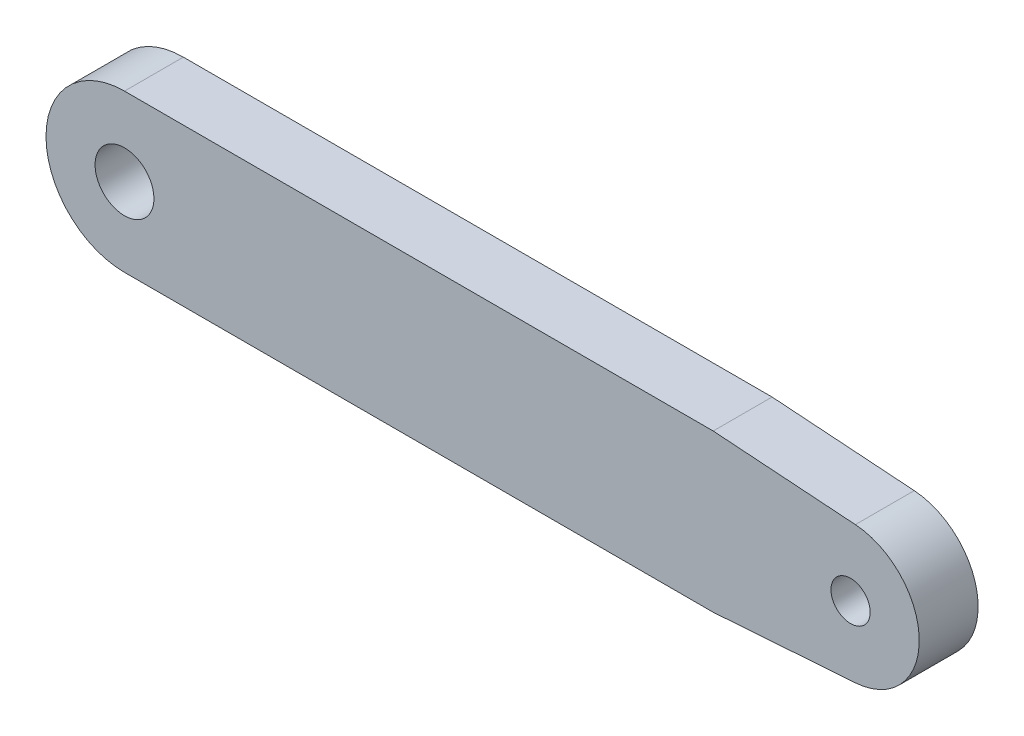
ISO-10303-21;
HEADER;
FILE_DESCRIPTION(('STEP AP214'),'2;1');
FILE_NAME('part.step','',(''),(''),'','','');
FILE_SCHEMA(('AUTOMOTIVE_DESIGN { 1 0 10303 214 1 1 1 1 }'));
ENDSEC;
DATA;
#1=APPLICATION_CONTEXT('core data for automotive mechanical design processes');
#2=APPLICATION_PROTOCOL_DEFINITION('international standard','automotive_design',2000,#1);
#3=PRODUCT_CONTEXT('',#1,'mechanical');
#4=PRODUCT('Part','Part','',(#3));
#5=PRODUCT_RELATED_PRODUCT_CATEGORY('part','',(#4));
#6=PRODUCT_DEFINITION_FORMATION('','',#4);
#7=PRODUCT_DEFINITION_CONTEXT('part definition',#1,'design');
#8=PRODUCT_DEFINITION('design','',#6,#7);
#9=PRODUCT_DEFINITION_SHAPE('','',#8);
#10=(LENGTH_UNIT() NAMED_UNIT(*) SI_UNIT(.MILLI.,.METRE.));
#11=(NAMED_UNIT(*) PLANE_ANGLE_UNIT() SI_UNIT($,.RADIAN.));
#12=(NAMED_UNIT(*) SI_UNIT($,.STERADIAN.) SOLID_ANGLE_UNIT());
#13=UNCERTAINTY_MEASURE_WITH_UNIT(LENGTH_MEASURE(1.E-05),#10,'distance_accuracy_value','');
#14=(GEOMETRIC_REPRESENTATION_CONTEXT(3) GLOBAL_UNCERTAINTY_ASSIGNED_CONTEXT((#13)) GLOBAL_UNIT_ASSIGNED_CONTEXT((#10,
#11,#12)) REPRESENTATION_CONTEXT('',''));
#15=CARTESIAN_POINT('',(0.,0.,0.));
#16=DIRECTION('',(0.,0.,1.));
#17=DIRECTION('',(1.,0.,0.));
#18=AXIS2_PLACEMENT_3D('',#15,#16,#17);
#19=CARTESIAN_POINT('',(-37.,0.,3.));
#20=DIRECTION('',(0.,0.,1.));
#21=DIRECTION('',(1.,0.,0.));
#22=AXIS2_PLACEMENT_3D('',#19,#20,#21);
#23=PLANE('',#22);
#24=CARTESIAN_POINT('',(-37.,0.,3.));
#25=DIRECTION('',(0.,0.,1.));
#26=DIRECTION('',(1.,0.,0.));
#27=AXIS2_PLACEMENT_3D('',#24,#25,#26);
#28=CIRCLE('',#27,1.5);
#29=CARTESIAN_POINT('',(-35.5,0.,3.));
#30=VERTEX_POINT('',#29);
#31=EDGE_CURVE('E119',#30,#30,#28,.T.);
#32=ORIENTED_EDGE('',*,*,#31,.F.);
#33=EDGE_LOOP('',(#32));
#34=FACE_BOUND('',#33,.T.);
#35=CARTESIAN_POINT('',(-37.,0.,3.));
#36=DIRECTION('',(0.,0.,1.));
#37=DIRECTION('',(1.,0.,0.));
#38=AXIS2_PLACEMENT_3D('',#35,#36,#37);
#39=CIRCLE('',#38,4.);
#40=CARTESIAN_POINT('',(-37.,4.,3.));
#41=VERTEX_POINT('',#40);
#42=CARTESIAN_POINT('',(-37.,-4.,3.));
#43=VERTEX_POINT('',#42);
#44=EDGE_CURVE('E126',#41,#43,#39,.T.);
#45=ORIENTED_EDGE('',*,*,#44,.T.);
#46=DIRECTION('',(1.,0.,0.));
#47=VECTOR('',#46,1.);
#48=CARTESIAN_POINT('',(-37.,-4.,3.));
#49=LINE('',#48,#47);
#50=CARTESIAN_POINT('',(-7.,-4.,3.));
#51=VERTEX_POINT('',#50);
#52=EDGE_CURVE('E84',#43,#51,#49,.T.);
#53=ORIENTED_EDGE('',*,*,#52,.T.);
#54=DIRECTION('',(0.997545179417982,0.0700258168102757,0.));
#55=VECTOR('',#54,1.);
#56=CARTESIAN_POINT('',(-7.,-4.,3.));
#57=LINE('',#56,#55);
#58=CARTESIAN_POINT('',(0.245090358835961,-3.49140812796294,3.));
#59=VERTEX_POINT('',#58);
#60=EDGE_CURVE('E97',#51,#59,#57,.T.);
#61=ORIENTED_EDGE('',*,*,#60,.T.);
#62=CARTESIAN_POINT('',(0.,0.,3.));
#63=DIRECTION('',(0.,0.,1.));
#64=DIRECTION('',(1.,0.,0.));
#65=AXIS2_PLACEMENT_3D('',#62,#63,#64);
#66=CIRCLE('',#65,3.5);
#67=CARTESIAN_POINT('',(0.245090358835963,3.49140812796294,3.));
#68=VERTEX_POINT('',#67);
#69=EDGE_CURVE('E91',#59,#68,#66,.T.);
#70=ORIENTED_EDGE('',*,*,#69,.T.);
#71=DIRECTION('',(-0.997545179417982,0.0700258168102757,0.));
#72=VECTOR('',#71,1.);
#73=CARTESIAN_POINT('',(-7.,4.,3.));
#74=LINE('',#73,#72);
#75=CARTESIAN_POINT('',(-7.,4.,3.));
#76=VERTEX_POINT('',#75);
#77=EDGE_CURVE('E95',#68,#76,#74,.T.);
#78=ORIENTED_EDGE('',*,*,#77,.T.);
#79=DIRECTION('',(-1.,0.,0.));
#80=VECTOR('',#79,1.);
#81=CARTESIAN_POINT('',(-37.,4.,3.));
#82=LINE('',#81,#80);
#83=EDGE_CURVE('E47',#76,#41,#82,.T.);
#84=ORIENTED_EDGE('',*,*,#83,.T.);
#85=EDGE_LOOP('',(#45,#53,#61,#70,#78,#84));
#86=FACE_BOUND('',#85,.T.);
#87=CARTESIAN_POINT('',(0.,0.,3.));
#88=DIRECTION('',(0.,0.,1.));
#89=DIRECTION('',(1.,0.,0.));
#90=AXIS2_PLACEMENT_3D('',#87,#88,#89);
#91=CIRCLE('',#90,1.);
#92=CARTESIAN_POINT('',(1.,0.,3.));
#93=VERTEX_POINT('',#92);
#94=EDGE_CURVE('E168',#93,#93,#91,.T.);
#95=ORIENTED_EDGE('',*,*,#94,.F.);
#96=EDGE_LOOP('',(#95));
#97=FACE_BOUND('',#96,.T.);
#98=ADVANCED_FACE('F30',(#34,#86,#97),#23,.T.);
#99=CARTESIAN_POINT('',(-37.,0.,0.));
#100=DIRECTION('',(0.,0.,1.));
#101=DIRECTION('',(1.,0.,0.));
#102=AXIS2_PLACEMENT_3D('',#99,#100,#101);
#103=PLANE('',#102);
#104=CARTESIAN_POINT('',(-37.,0.,0.));
#105=DIRECTION('',(0.,0.,1.));
#106=DIRECTION('',(1.,0.,0.));
#107=AXIS2_PLACEMENT_3D('',#104,#105,#106);
#108=CIRCLE('',#107,4.);
#109=CARTESIAN_POINT('',(-37.,4.,0.));
#110=VERTEX_POINT('',#109);
#111=CARTESIAN_POINT('',(-37.,-4.,0.));
#112=VERTEX_POINT('',#111);
#113=EDGE_CURVE('E115',#110,#112,#108,.T.);
#114=ORIENTED_EDGE('',*,*,#113,.F.);
#115=DIRECTION('',(-1.,0.,0.));
#116=VECTOR('',#115,1.);
#117=CARTESIAN_POINT('',(-37.,4.,0.));
#118=LINE('',#117,#116);
#119=CARTESIAN_POINT('',(-7.,4.,0.));
#120=VERTEX_POINT('',#119);
#121=EDGE_CURVE('E76',#120,#110,#118,.T.);
#122=ORIENTED_EDGE('',*,*,#121,.F.);
#123=DIRECTION('',(-0.997545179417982,0.0700258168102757,0.));
#124=VECTOR('',#123,1.);
#125=CARTESIAN_POINT('',(-7.,4.,0.));
#126=LINE('',#125,#124);
#127=CARTESIAN_POINT('',(0.245090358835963,3.49140812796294,0.));
#128=VERTEX_POINT('',#127);
#129=EDGE_CURVE('E70',#128,#120,#126,.T.);
#130=ORIENTED_EDGE('',*,*,#129,.F.);
#131=CARTESIAN_POINT('',(0.,0.,0.));
#132=DIRECTION('',(0.,0.,1.));
#133=DIRECTION('',(1.,0.,0.));
#134=AXIS2_PLACEMENT_3D('',#131,#132,#133);
#135=CIRCLE('',#134,3.5);
#136=CARTESIAN_POINT('',(0.245090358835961,-3.49140812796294,0.));
#137=VERTEX_POINT('',#136);
#138=EDGE_CURVE('E105',#137,#128,#135,.T.);
#139=ORIENTED_EDGE('',*,*,#138,.F.);
#140=DIRECTION('',(0.997545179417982,0.0700258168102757,0.));
#141=VECTOR('',#140,1.);
#142=CARTESIAN_POINT('',(-7.,-4.,0.));
#143=LINE('',#142,#141);
#144=CARTESIAN_POINT('',(-7.,-4.,0.));
#145=VERTEX_POINT('',#144);
#146=EDGE_CURVE('E121',#145,#137,#143,.T.);
#147=ORIENTED_EDGE('',*,*,#146,.F.);
#148=DIRECTION('',(1.,0.,0.));
#149=VECTOR('',#148,1.);
#150=CARTESIAN_POINT('',(-37.,-4.,0.));
#151=LINE('',#150,#149);
#152=EDGE_CURVE('E118',#112,#145,#151,.T.);
#153=ORIENTED_EDGE('',*,*,#152,.F.);
#154=EDGE_LOOP('',(#114,#122,#130,#139,#147,#153));
#155=FACE_BOUND('',#154,.T.);
#156=CARTESIAN_POINT('',(-37.,0.,0.));
#157=DIRECTION('',(0.,0.,1.));
#158=DIRECTION('',(1.,0.,0.));
#159=AXIS2_PLACEMENT_3D('',#156,#157,#158);
#160=CIRCLE('',#159,1.5);
#161=CARTESIAN_POINT('',(-35.5,0.,0.));
#162=VERTEX_POINT('',#161);
#163=EDGE_CURVE('E174',#162,#162,#160,.T.);
#164=ORIENTED_EDGE('',*,*,#163,.T.);
#165=EDGE_LOOP('',(#164));
#166=FACE_BOUND('',#165,.T.);
#167=CARTESIAN_POINT('',(0.,0.,0.));
#168=DIRECTION('',(0.,0.,1.));
#169=DIRECTION('',(1.,0.,0.));
#170=AXIS2_PLACEMENT_3D('',#167,#168,#169);
#171=CIRCLE('',#170,1.);
#172=CARTESIAN_POINT('',(1.,0.,0.));
#173=VERTEX_POINT('',#172);
#174=EDGE_CURVE('E171',#173,#173,#171,.T.);
#175=ORIENTED_EDGE('',*,*,#174,.T.);
#176=EDGE_LOOP('',(#175));
#177=FACE_BOUND('',#176,.T.);
#178=ADVANCED_FACE('F135',(#155,#166,#177),#103,.F.);
#179=CARTESIAN_POINT('',(-37.,0.,3.));
#180=DIRECTION('',(0.,0.,-1.));
#181=DIRECTION('',(-1.,0.,0.));
#182=AXIS2_PLACEMENT_3D('',#179,#180,#181);
#183=CYLINDRICAL_SURFACE('',#182,4.);
#184=ORIENTED_EDGE('',*,*,#113,.T.);
#185=DIRECTION('',(0.,0.,-1.));
#186=VECTOR('',#185,1.);
#187=CARTESIAN_POINT('',(-37.,-4.,3.));
#188=LINE('',#187,#186);
#189=EDGE_CURVE('E11',#43,#112,#188,.T.);
#190=ORIENTED_EDGE('',*,*,#189,.F.);
#191=ORIENTED_EDGE('',*,*,#44,.F.);
#192=DIRECTION('',(0.,0.,-1.));
#193=VECTOR('',#192,1.);
#194=CARTESIAN_POINT('',(-37.,4.,3.));
#195=LINE('',#194,#193);
#196=EDGE_CURVE('E111',#41,#110,#195,.T.);
#197=ORIENTED_EDGE('',*,*,#196,.T.);
#198=EDGE_LOOP('',(#184,#190,#191,#197));
#199=FACE_BOUND('',#198,.T.);
#200=ADVANCED_FACE('F32',(#199),#183,.T.);
#201=CARTESIAN_POINT('',(-37.,-4.,3.));
#202=DIRECTION('',(0.,1.,0.));
#203=DIRECTION('',(0.,0.,1.));
#204=AXIS2_PLACEMENT_3D('',#201,#202,#203);
#205=PLANE('',#204);
#206=ORIENTED_EDGE('',*,*,#152,.T.);
#207=DIRECTION('',(0.,0.,-1.));
#208=VECTOR('',#207,1.);
#209=CARTESIAN_POINT('',(-7.,-4.,3.));
#210=LINE('',#209,#208);
#211=EDGE_CURVE('E39',#51,#145,#210,.T.);
#212=ORIENTED_EDGE('',*,*,#211,.F.);
#213=ORIENTED_EDGE('',*,*,#52,.F.);
#214=ORIENTED_EDGE('',*,*,#189,.T.);
#215=EDGE_LOOP('',(#206,#212,#213,#214));
#216=FACE_BOUND('',#215,.T.);
#217=ADVANCED_FACE('F215',(#216),#205,.F.);
#218=CARTESIAN_POINT('',(-7.,-4.,3.));
#219=DIRECTION('',(-0.0700258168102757,0.997545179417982,0.));
#220=DIRECTION('',(-0.997545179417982,-0.0700258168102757,0.));
#221=AXIS2_PLACEMENT_3D('',#218,#219,#220);
#222=PLANE('',#221);
#223=ORIENTED_EDGE('',*,*,#146,.T.);
#224=DIRECTION('',(0.,0.,-1.));
#225=VECTOR('',#224,1.);
#226=CARTESIAN_POINT('',(0.245090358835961,-3.49140812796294,3.));
#227=LINE('',#226,#225);
#228=EDGE_CURVE('E106',#59,#137,#227,.T.);
#229=ORIENTED_EDGE('',*,*,#228,.F.);
#230=ORIENTED_EDGE('',*,*,#60,.F.);
#231=ORIENTED_EDGE('',*,*,#211,.T.);
#232=EDGE_LOOP('',(#223,#229,#230,#231));
#233=FACE_BOUND('',#232,.T.);
#234=ADVANCED_FACE('F132',(#233),#222,.F.);
#235=CARTESIAN_POINT('',(0.,0.,3.));
#236=DIRECTION('',(0.,0.,-1.));
#237=DIRECTION('',(-1.,0.,0.));
#238=AXIS2_PLACEMENT_3D('',#235,#236,#237);
#239=CYLINDRICAL_SURFACE('',#238,3.5);
#240=ORIENTED_EDGE('',*,*,#138,.T.);
#241=DIRECTION('',(0.,0.,-1.));
#242=VECTOR('',#241,1.);
#243=CARTESIAN_POINT('',(0.245090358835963,3.49140812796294,3.));
#244=LINE('',#243,#242);
#245=EDGE_CURVE('E102',#68,#128,#244,.T.);
#246=ORIENTED_EDGE('',*,*,#245,.F.);
#247=ORIENTED_EDGE('',*,*,#69,.F.);
#248=ORIENTED_EDGE('',*,*,#228,.T.);
#249=EDGE_LOOP('',(#240,#246,#247,#248));
#250=FACE_BOUND('',#249,.T.);
#251=ADVANCED_FACE('F103',(#250),#239,.T.);
#252=CARTESIAN_POINT('',(-7.,4.,3.));
#253=DIRECTION('',(-0.0700258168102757,-0.997545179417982,0.));
#254=DIRECTION('',(0.997545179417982,-0.0700258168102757,0.));
#255=AXIS2_PLACEMENT_3D('',#252,#253,#254);
#256=PLANE('',#255);
#257=ORIENTED_EDGE('',*,*,#129,.T.);
#258=DIRECTION('',(0.,0.,-1.));
#259=VECTOR('',#258,1.);
#260=CARTESIAN_POINT('',(-7.,4.,3.));
#261=LINE('',#260,#259);
#262=EDGE_CURVE('E107',#76,#120,#261,.T.);
#263=ORIENTED_EDGE('',*,*,#262,.F.);
#264=ORIENTED_EDGE('',*,*,#77,.F.);
#265=ORIENTED_EDGE('',*,*,#245,.T.);
#266=EDGE_LOOP('',(#257,#263,#264,#265));
#267=FACE_BOUND('',#266,.T.);
#268=ADVANCED_FACE('F109',(#267),#256,.F.);
#269=CARTESIAN_POINT('',(-37.,4.,3.));
#270=DIRECTION('',(0.,-1.,0.));
#271=DIRECTION('',(0.,0.,-1.));
#272=AXIS2_PLACEMENT_3D('',#269,#270,#271);
#273=PLANE('',#272);
#274=ORIENTED_EDGE('',*,*,#121,.T.);
#275=ORIENTED_EDGE('',*,*,#196,.F.);
#276=ORIENTED_EDGE('',*,*,#83,.F.);
#277=ORIENTED_EDGE('',*,*,#262,.T.);
#278=EDGE_LOOP('',(#274,#275,#276,#277));
#279=FACE_BOUND('',#278,.T.);
#280=ADVANCED_FACE('F140',(#279),#273,.F.);
#281=CARTESIAN_POINT('',(-37.,0.,3.));
#282=DIRECTION('',(0.,0.,-1.));
#283=DIRECTION('',(-1.,0.,0.));
#284=AXIS2_PLACEMENT_3D('',#281,#282,#283);
#285=CYLINDRICAL_SURFACE('',#284,1.5);
#286=ORIENTED_EDGE('',*,*,#31,.T.);
#287=EDGE_LOOP('',(#286));
#288=FACE_BOUND('',#287,.T.);
#289=ORIENTED_EDGE('',*,*,#163,.F.);
#290=EDGE_LOOP('',(#289));
#291=FACE_BOUND('',#290,.T.);
#292=ADVANCED_FACE('F142',(#288,#291),#285,.F.);
#293=CARTESIAN_POINT('',(0.,0.,3.));
#294=DIRECTION('',(0.,0.,-1.));
#295=DIRECTION('',(-1.,0.,0.));
#296=AXIS2_PLACEMENT_3D('',#293,#294,#295);
#297=CYLINDRICAL_SURFACE('',#296,1.);
#298=ORIENTED_EDGE('',*,*,#94,.T.);
#299=EDGE_LOOP('',(#298));
#300=FACE_BOUND('',#299,.T.);
#301=ORIENTED_EDGE('',*,*,#174,.F.);
#302=EDGE_LOOP('',(#301));
#303=FACE_BOUND('',#302,.T.);
#304=ADVANCED_FACE('F148',(#300,#303),#297,.F.);
#305=CLOSED_SHELL('',(#98,#178,#200,#217,#234,#251,#268,#280,#292,#304));
#306=MANIFOLD_SOLID_BREP('B2',#305);
#307=ADVANCED_BREP_SHAPE_REPRESENTATION('',(#18,#306),#14);
#308=SHAPE_DEFINITION_REPRESENTATION(#9,#307);
ENDSEC;
END-ISO-10303-21;
